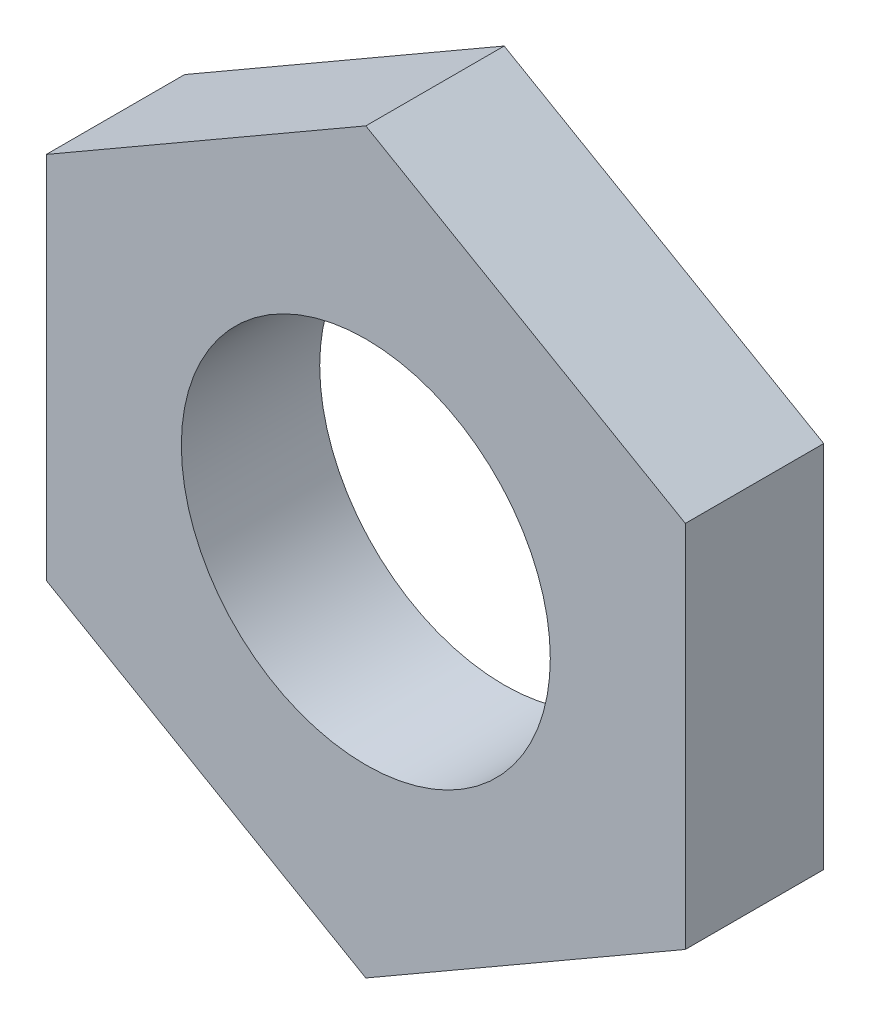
ISO-10303-21;
HEADER;
FILE_DESCRIPTION(('STEP AP214'),'2;1');
FILE_NAME('part.step','',(''),(''),'','','');
FILE_SCHEMA(('AUTOMOTIVE_DESIGN { 1 0 10303 214 1 1 1 1 }'));
ENDSEC;
DATA;
#1=APPLICATION_CONTEXT('core data for automotive mechanical design processes');
#2=APPLICATION_PROTOCOL_DEFINITION('international standard','automotive_design',2000,#1);
#3=PRODUCT_CONTEXT('',#1,'mechanical');
#4=PRODUCT('Part','Part','',(#3));
#5=PRODUCT_RELATED_PRODUCT_CATEGORY('part','',(#4));
#6=PRODUCT_DEFINITION_FORMATION('','',#4);
#7=PRODUCT_DEFINITION_CONTEXT('part definition',#1,'design');
#8=PRODUCT_DEFINITION('design','',#6,#7);
#9=PRODUCT_DEFINITION_SHAPE('','',#8);
#10=(LENGTH_UNIT() NAMED_UNIT(*) SI_UNIT(.MILLI.,.METRE.));
#11=(NAMED_UNIT(*) PLANE_ANGLE_UNIT() SI_UNIT($,.RADIAN.));
#12=(NAMED_UNIT(*) SI_UNIT($,.STERADIAN.) SOLID_ANGLE_UNIT());
#13=UNCERTAINTY_MEASURE_WITH_UNIT(LENGTH_MEASURE(1.E-05),#10,'distance_accuracy_value','');
#14=(GEOMETRIC_REPRESENTATION_CONTEXT(3) GLOBAL_UNCERTAINTY_ASSIGNED_CONTEXT((#13)) GLOBAL_UNIT_ASSIGNED_CONTEXT((#10,
#11,#12)) REPRESENTATION_CONTEXT('',''));
#15=CARTESIAN_POINT('',(0.,0.,0.));
#16=DIRECTION('',(0.,0.,1.));
#17=DIRECTION('',(1.,0.,0.));
#18=AXIS2_PLACEMENT_3D('',#15,#16,#17);
#19=CARTESIAN_POINT('',(0.,0.,7.5));
#20=DIRECTION('',(0.,0.,1.));
#21=DIRECTION('',(1.,0.,0.));
#22=AXIS2_PLACEMENT_3D('',#19,#20,#21);
#23=PLANE('',#22);
#24=DIRECTION('',(-0.866025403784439,-0.5,0.));
#25=VECTOR('',#24,1.);
#26=CARTESIAN_POINT('',(0.,40.,7.5));
#27=LINE('',#26,#25);
#28=CARTESIAN_POINT('',(0.,40.,7.5));
#29=VERTEX_POINT('',#28);
#30=CARTESIAN_POINT('',(-34.6410161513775,20.,7.5));
#31=VERTEX_POINT('',#30);
#32=EDGE_CURVE('E152',#29,#31,#27,.T.);
#33=ORIENTED_EDGE('',*,*,#32,.T.);
#34=DIRECTION('',(0.,-1.,0.));
#35=VECTOR('',#34,1.);
#36=CARTESIAN_POINT('',(-34.6410161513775,20.,7.5));
#37=LINE('',#36,#35);
#38=CARTESIAN_POINT('',(-34.6410161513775,-20.,7.5));
#39=VERTEX_POINT('',#38);
#40=EDGE_CURVE('E100',#31,#39,#37,.T.);
#41=ORIENTED_EDGE('',*,*,#40,.T.);
#42=DIRECTION('',(0.866025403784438,-0.5,0.));
#43=VECTOR('',#42,1.);
#44=CARTESIAN_POINT('',(-34.6410161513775,-20.,7.5));
#45=LINE('',#44,#43);
#46=CARTESIAN_POINT('',(0.,-40.,7.5));
#47=VERTEX_POINT('',#46);
#48=EDGE_CURVE('E113',#39,#47,#45,.T.);
#49=ORIENTED_EDGE('',*,*,#48,.T.);
#50=DIRECTION('',(0.866025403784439,0.5,0.));
#51=VECTOR('',#50,1.);
#52=CARTESIAN_POINT('',(0.,-40.,7.5));
#53=LINE('',#52,#51);
#54=CARTESIAN_POINT('',(34.6410161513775,-20.,7.5));
#55=VERTEX_POINT('',#54);
#56=EDGE_CURVE('E107',#47,#55,#53,.T.);
#57=ORIENTED_EDGE('',*,*,#56,.T.);
#58=DIRECTION('',(0.,1.,0.));
#59=VECTOR('',#58,1.);
#60=CARTESIAN_POINT('',(34.6410161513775,-20.,7.5));
#61=LINE('',#60,#59);
#62=CARTESIAN_POINT('',(34.6410161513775,20.,7.5));
#63=VERTEX_POINT('',#62);
#64=EDGE_CURVE('E111',#55,#63,#61,.T.);
#65=ORIENTED_EDGE('',*,*,#64,.T.);
#66=DIRECTION('',(-0.866025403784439,0.5,0.));
#67=VECTOR('',#66,1.);
#68=CARTESIAN_POINT('',(34.6410161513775,20.,7.5));
#69=LINE('',#68,#67);
#70=EDGE_CURVE('E63',#63,#29,#69,.T.);
#71=ORIENTED_EDGE('',*,*,#70,.T.);
#72=EDGE_LOOP('',(#33,#41,#49,#57,#65,#71));
#73=FACE_BOUND('',#72,.T.);
#74=CARTESIAN_POINT('',(0.,0.,7.5));
#75=DIRECTION('',(0.,0.,1.));
#76=DIRECTION('',(1.,0.,0.));
#77=AXIS2_PLACEMENT_3D('',#74,#75,#76);
#78=CIRCLE('',#77,20.);
#79=CARTESIAN_POINT('',(20.,0.,7.5));
#80=VERTEX_POINT('',#79);
#81=EDGE_CURVE('E140',#80,#80,#78,.T.);
#82=ORIENTED_EDGE('',*,*,#81,.F.);
#83=EDGE_LOOP('',(#82));
#84=FACE_BOUND('',#83,.T.);
#85=ADVANCED_FACE('F45',(#73,#84),#23,.T.);
#86=CARTESIAN_POINT('',(0.,0.,-7.5));
#87=DIRECTION('',(0.,0.,1.));
#88=DIRECTION('',(1.,0.,0.));
#89=AXIS2_PLACEMENT_3D('',#86,#87,#88);
#90=PLANE('',#89);
#91=DIRECTION('',(-0.866025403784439,-0.5,0.));
#92=VECTOR('',#91,1.);
#93=CARTESIAN_POINT('',(0.,40.,-7.5));
#94=LINE('',#93,#92);
#95=CARTESIAN_POINT('',(0.,40.,-7.5));
#96=VERTEX_POINT('',#95);
#97=CARTESIAN_POINT('',(-34.6410161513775,20.,-7.5));
#98=VERTEX_POINT('',#97);
#99=EDGE_CURVE('E135',#96,#98,#94,.T.);
#100=ORIENTED_EDGE('',*,*,#99,.F.);
#101=DIRECTION('',(-0.866025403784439,0.5,0.));
#102=VECTOR('',#101,1.);
#103=CARTESIAN_POINT('',(34.6410161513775,20.,-7.5));
#104=LINE('',#103,#102);
#105=CARTESIAN_POINT('',(34.6410161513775,20.,-7.5));
#106=VERTEX_POINT('',#105);
#107=EDGE_CURVE('E92',#106,#96,#104,.T.);
#108=ORIENTED_EDGE('',*,*,#107,.F.);
#109=DIRECTION('',(0.,1.,0.));
#110=VECTOR('',#109,1.);
#111=CARTESIAN_POINT('',(34.6410161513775,-20.,-7.5));
#112=LINE('',#111,#110);
#113=CARTESIAN_POINT('',(34.6410161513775,-20.,-7.5));
#114=VERTEX_POINT('',#113);
#115=EDGE_CURVE('E86',#114,#106,#112,.T.);
#116=ORIENTED_EDGE('',*,*,#115,.F.);
#117=DIRECTION('',(0.866025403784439,0.5,0.));
#118=VECTOR('',#117,1.);
#119=CARTESIAN_POINT('',(0.,-40.,-7.5));
#120=LINE('',#119,#118);
#121=CARTESIAN_POINT('',(0.,-40.,-7.5));
#122=VERTEX_POINT('',#121);
#123=EDGE_CURVE('E122',#122,#114,#120,.T.);
#124=ORIENTED_EDGE('',*,*,#123,.F.);
#125=DIRECTION('',(0.866025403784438,-0.5,0.));
#126=VECTOR('',#125,1.);
#127=CARTESIAN_POINT('',(-34.6410161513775,-20.,-7.5));
#128=LINE('',#127,#126);
#129=CARTESIAN_POINT('',(-34.6410161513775,-20.,-7.5));
#130=VERTEX_POINT('',#129);
#131=EDGE_CURVE('E143',#130,#122,#128,.T.);
#132=ORIENTED_EDGE('',*,*,#131,.F.);
#133=DIRECTION('',(0.,-1.,0.));
#134=VECTOR('',#133,1.);
#135=CARTESIAN_POINT('',(-34.6410161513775,20.,-7.5));
#136=LINE('',#135,#134);
#137=EDGE_CURVE('E139',#98,#130,#136,.T.);
#138=ORIENTED_EDGE('',*,*,#137,.F.);
#139=EDGE_LOOP('',(#100,#108,#116,#124,#132,#138));
#140=FACE_BOUND('',#139,.T.);
#141=CARTESIAN_POINT('',(0.,0.,-7.5));
#142=DIRECTION('',(0.,0.,1.));
#143=DIRECTION('',(1.,0.,0.));
#144=AXIS2_PLACEMENT_3D('',#141,#142,#143);
#145=CIRCLE('',#144,20.);
#146=CARTESIAN_POINT('',(20.,0.,-7.5));
#147=VERTEX_POINT('',#146);
#148=EDGE_CURVE('E249',#147,#147,#145,.T.);
#149=ORIENTED_EDGE('',*,*,#148,.T.);
#150=EDGE_LOOP('',(#149));
#151=FACE_BOUND('',#150,.T.);
#152=ADVANCED_FACE('F165',(#140,#151),#90,.F.);
#153=CARTESIAN_POINT('',(0.,40.,7.5));
#154=DIRECTION('',(0.5,-0.866025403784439,0.));
#155=DIRECTION('',(0.866025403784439,0.5,0.));
#156=AXIS2_PLACEMENT_3D('',#153,#154,#155);
#157=PLANE('',#156);
#158=ORIENTED_EDGE('',*,*,#99,.T.);
#159=DIRECTION('',(0.,0.,-1.));
#160=VECTOR('',#159,1.);
#161=CARTESIAN_POINT('',(-34.6410161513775,20.,7.5));
#162=LINE('',#161,#160);
#163=EDGE_CURVE('E11',#31,#98,#162,.T.);
#164=ORIENTED_EDGE('',*,*,#163,.F.);
#165=ORIENTED_EDGE('',*,*,#32,.F.);
#166=DIRECTION('',(0.,0.,-1.));
#167=VECTOR('',#166,1.);
#168=CARTESIAN_POINT('',(0.,40.,7.5));
#169=LINE('',#168,#167);
#170=EDGE_CURVE('E131',#29,#96,#169,.T.);
#171=ORIENTED_EDGE('',*,*,#170,.T.);
#172=EDGE_LOOP('',(#158,#164,#165,#171));
#173=FACE_BOUND('',#172,.T.);
#174=ADVANCED_FACE('F47',(#173),#157,.F.);
#175=CARTESIAN_POINT('',(-34.6410161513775,20.,7.5));
#176=DIRECTION('',(1.,0.,0.));
#177=DIRECTION('',(0.,1.,0.));
#178=AXIS2_PLACEMENT_3D('',#175,#176,#177);
#179=PLANE('',#178);
#180=ORIENTED_EDGE('',*,*,#137,.T.);
#181=DIRECTION('',(0.,0.,-1.));
#182=VECTOR('',#181,1.);
#183=CARTESIAN_POINT('',(-34.6410161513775,-20.,7.5));
#184=LINE('',#183,#182);
#185=EDGE_CURVE('E55',#39,#130,#184,.T.);
#186=ORIENTED_EDGE('',*,*,#185,.F.);
#187=ORIENTED_EDGE('',*,*,#40,.F.);
#188=ORIENTED_EDGE('',*,*,#163,.T.);
#189=EDGE_LOOP('',(#180,#186,#187,#188));
#190=FACE_BOUND('',#189,.T.);
#191=ADVANCED_FACE('F190',(#190),#179,.F.);
#192=CARTESIAN_POINT('',(-34.6410161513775,-20.,7.5));
#193=DIRECTION('',(0.5,0.866025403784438,0.));
#194=DIRECTION('',(-0.866025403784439,0.5,0.));
#195=AXIS2_PLACEMENT_3D('',#192,#193,#194);
#196=PLANE('',#195);
#197=ORIENTED_EDGE('',*,*,#131,.T.);
#198=DIRECTION('',(0.,0.,-1.));
#199=VECTOR('',#198,1.);
#200=CARTESIAN_POINT('',(0.,-40.,7.5));
#201=LINE('',#200,#199);
#202=EDGE_CURVE('E124',#47,#122,#201,.T.);
#203=ORIENTED_EDGE('',*,*,#202,.F.);
#204=ORIENTED_EDGE('',*,*,#48,.F.);
#205=ORIENTED_EDGE('',*,*,#185,.T.);
#206=EDGE_LOOP('',(#197,#203,#204,#205));
#207=FACE_BOUND('',#206,.T.);
#208=ADVANCED_FACE('F162',(#207),#196,.F.);
#209=CARTESIAN_POINT('',(0.,-40.,7.5));
#210=DIRECTION('',(-0.5,0.866025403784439,0.));
#211=DIRECTION('',(-0.866025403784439,-0.5,0.));
#212=AXIS2_PLACEMENT_3D('',#209,#210,#211);
#213=PLANE('',#212);
#214=ORIENTED_EDGE('',*,*,#123,.T.);
#215=DIRECTION('',(0.,0.,-1.));
#216=VECTOR('',#215,1.);
#217=CARTESIAN_POINT('',(34.6410161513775,-20.,7.5));
#218=LINE('',#217,#216);
#219=EDGE_CURVE('E119',#55,#114,#218,.T.);
#220=ORIENTED_EDGE('',*,*,#219,.F.);
#221=ORIENTED_EDGE('',*,*,#56,.F.);
#222=ORIENTED_EDGE('',*,*,#202,.T.);
#223=EDGE_LOOP('',(#214,#220,#221,#222));
#224=FACE_BOUND('',#223,.T.);
#225=ADVANCED_FACE('F120',(#224),#213,.F.);
#226=CARTESIAN_POINT('',(34.6410161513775,-20.,7.5));
#227=DIRECTION('',(-1.,0.,0.));
#228=DIRECTION('',(0.,0.,1.));
#229=AXIS2_PLACEMENT_3D('',#226,#227,#228);
#230=PLANE('',#229);
#231=ORIENTED_EDGE('',*,*,#115,.T.);
#232=DIRECTION('',(0.,0.,-1.));
#233=VECTOR('',#232,1.);
#234=CARTESIAN_POINT('',(34.6410161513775,20.,7.5));
#235=LINE('',#234,#233);
#236=EDGE_CURVE('E125',#63,#106,#235,.T.);
#237=ORIENTED_EDGE('',*,*,#236,.F.);
#238=ORIENTED_EDGE('',*,*,#64,.F.);
#239=ORIENTED_EDGE('',*,*,#219,.T.);
#240=EDGE_LOOP('',(#231,#237,#238,#239));
#241=FACE_BOUND('',#240,.T.);
#242=ADVANCED_FACE('F127',(#241),#230,.F.);
#243=CARTESIAN_POINT('',(34.6410161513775,20.,7.5));
#244=DIRECTION('',(-0.5,-0.866025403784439,0.));
#245=DIRECTION('',(0.866025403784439,-0.5,0.));
#246=AXIS2_PLACEMENT_3D('',#243,#244,#245);
#247=PLANE('',#246);
#248=ORIENTED_EDGE('',*,*,#107,.T.);
#249=ORIENTED_EDGE('',*,*,#170,.F.);
#250=ORIENTED_EDGE('',*,*,#70,.F.);
#251=ORIENTED_EDGE('',*,*,#236,.T.);
#252=EDGE_LOOP('',(#248,#249,#250,#251));
#253=FACE_BOUND('',#252,.T.);
#254=ADVANCED_FACE('F170',(#253),#247,.F.);
#255=CARTESIAN_POINT('',(0.,0.,7.5));
#256=DIRECTION('',(0.,0.,-1.));
#257=DIRECTION('',(-1.,0.,0.));
#258=AXIS2_PLACEMENT_3D('',#255,#256,#257);
#259=CYLINDRICAL_SURFACE('',#258,20.);
#260=ORIENTED_EDGE('',*,*,#81,.T.);
#261=EDGE_LOOP('',(#260));
#262=FACE_BOUND('',#261,.T.);
#263=ORIENTED_EDGE('',*,*,#148,.F.);
#264=EDGE_LOOP('',(#263));
#265=FACE_BOUND('',#264,.T.);
#266=ADVANCED_FACE('F172',(#262,#265),#259,.F.);
#267=CLOSED_SHELL('',(#85,#152,#174,#191,#208,#225,#242,#254,#266));
#268=MANIFOLD_SOLID_BREP('B2',#267);
#269=ADVANCED_BREP_SHAPE_REPRESENTATION('',(#18,#268),#14);
#270=SHAPE_DEFINITION_REPRESENTATION(#9,#269);
ENDSEC;
END-ISO-10303-21;
